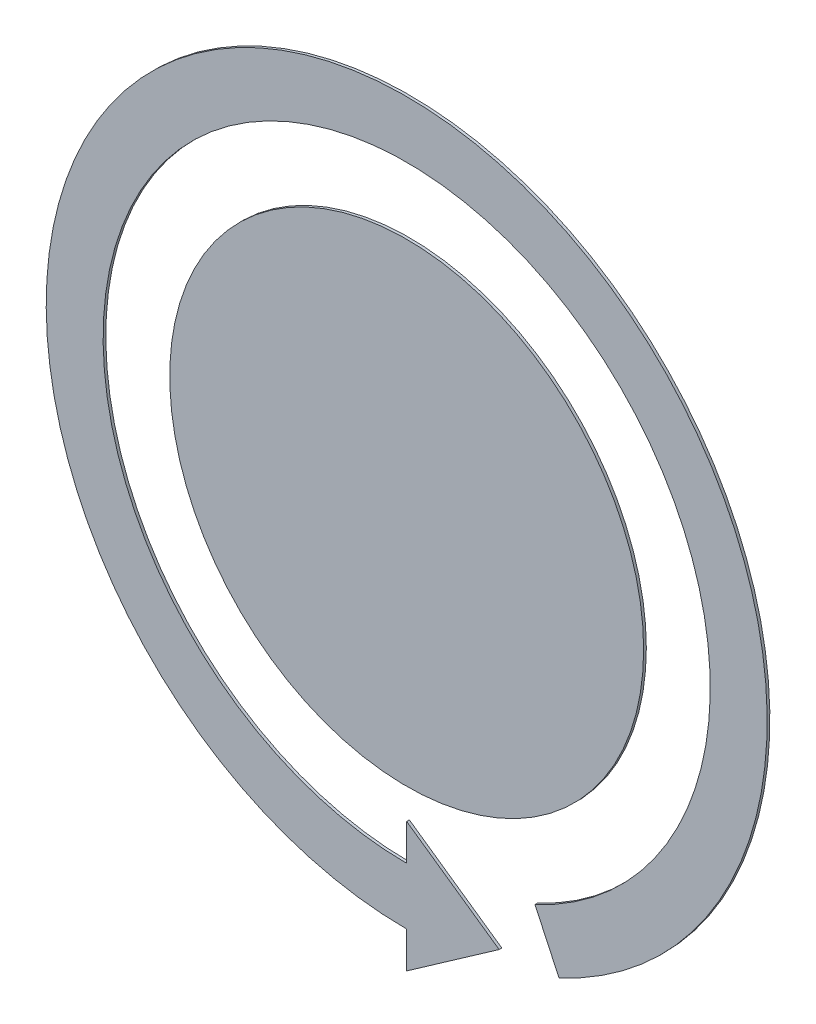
from build123d import *

# Parameters (mm, degrees)
SKIZZE1_R                         = 264.349234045
AUFSATZ_LINEAR_AUSTRAGEN1_DEPTH   = 3
AUFSATZ_LINEAR_AUSTRAGEN1_2_DEPTH = 3


with BuildPart() as part:
    # Skizze1 → Aufsatz-Linear austragen1 (new body)
    with BuildSketch(Plane.XY):
        Circle(SKIZZE1_R)
    extrude(amount=AUFSATZ_LINEAR_AUSTRAGEN1_DEPTH)


with BuildPart() as body_2:
    # Skizze1 → Aufsatz-Linear austragen1 2 (new body)
    with BuildSketch(Plane.XY):
        with BuildLine():
            Line((169.961218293, -364.483008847), (143.128369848, -306.93977966))
            ThreePointArc((143.128369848, -306.93977966), (-73.301728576, 330.642730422), (0, -338.670575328))
            Line((0, -338.670575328), (0, -298.202571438))
            Line((0, -298.202571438), (103.132265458, -370.416663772))
            Line((103.132265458, -370.416663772), (0, -442.630507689))
            Line((0, -442.630507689), (0, -402.162503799))
            ThreePointArc((0, -402.162503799), (-87.043897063, 392.629646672), (169.961218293, -364.483008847))
        make_face()
    extrude(amount=AUFSATZ_LINEAR_AUSTRAGEN1_2_DEPTH)


solid = Compound([part.part, body_2.part])
